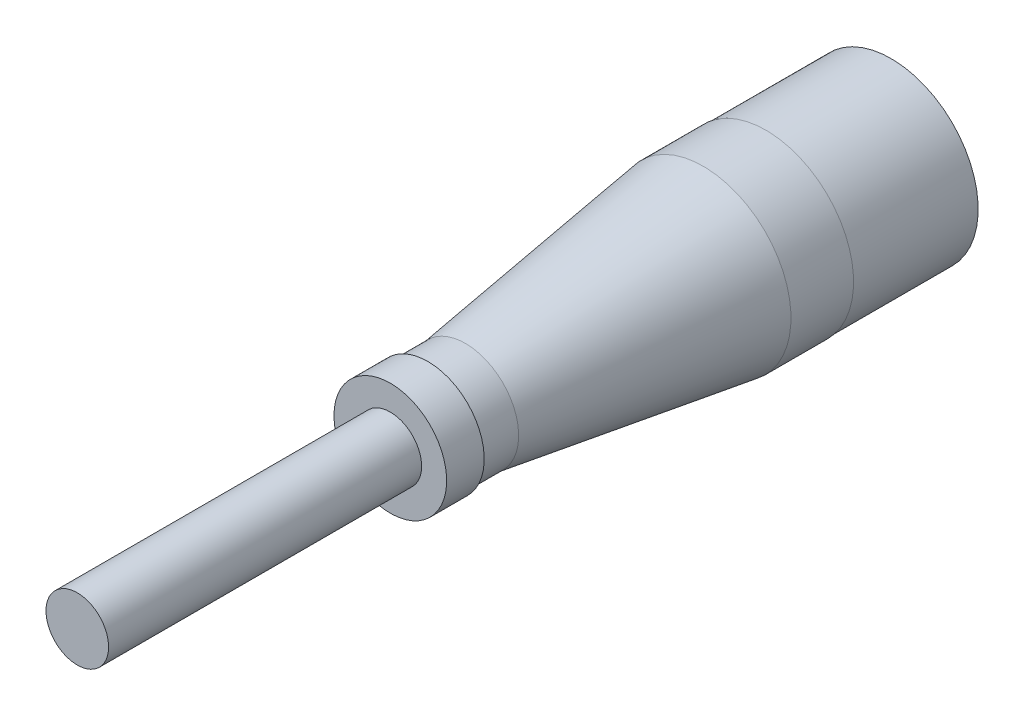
ISO-10303-21;
HEADER;
FILE_DESCRIPTION(('STEP AP214'),'2;1');
FILE_NAME('part.step','',(''),(''),'','','');
FILE_SCHEMA(('AUTOMOTIVE_DESIGN { 1 0 10303 214 1 1 1 1 }'));
ENDSEC;
DATA;
#1=APPLICATION_CONTEXT('core data for automotive mechanical design processes');
#2=APPLICATION_PROTOCOL_DEFINITION('international standard','automotive_design',2000,#1);
#3=PRODUCT_CONTEXT('',#1,'mechanical');
#4=PRODUCT('Part','Part','',(#3));
#5=PRODUCT_RELATED_PRODUCT_CATEGORY('part','',(#4));
#6=PRODUCT_DEFINITION_FORMATION('','',#4);
#7=PRODUCT_DEFINITION_CONTEXT('part definition',#1,'design');
#8=PRODUCT_DEFINITION('design','',#6,#7);
#9=PRODUCT_DEFINITION_SHAPE('','',#8);
#10=(LENGTH_UNIT() NAMED_UNIT(*) SI_UNIT(.MILLI.,.METRE.));
#11=(NAMED_UNIT(*) PLANE_ANGLE_UNIT() SI_UNIT($,.RADIAN.));
#12=(NAMED_UNIT(*) SI_UNIT($,.STERADIAN.) SOLID_ANGLE_UNIT());
#13=UNCERTAINTY_MEASURE_WITH_UNIT(LENGTH_MEASURE(1.E-05),#10,'distance_accuracy_value','');
#14=(GEOMETRIC_REPRESENTATION_CONTEXT(3) GLOBAL_UNCERTAINTY_ASSIGNED_CONTEXT((#13)) GLOBAL_UNIT_ASSIGNED_CONTEXT((#10,
#11,#12)) REPRESENTATION_CONTEXT('',''));
#15=CARTESIAN_POINT('',(0.,0.,0.));
#16=DIRECTION('',(0.,0.,1.));
#17=DIRECTION('',(1.,0.,0.));
#18=AXIS2_PLACEMENT_3D('',#15,#16,#17);
#19=CARTESIAN_POINT('',(-5.55111512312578E-13,1.22124532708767E-12,40.));
#20=DIRECTION('',(0.,0.,-0.999999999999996));
#21=DIRECTION('',(-1.,0.,0.));
#22=AXIS2_PLACEMENT_3D('',#19,#20,#21);
#23=PLANE('',#22);
#24=CARTESIAN_POINT('',(-5.55111512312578E-13,1.22124532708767E-12,40.));
#25=DIRECTION('',(0.,0.,-0.999999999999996));
#26=DIRECTION('',(-1.,0.,0.));
#27=AXIS2_PLACEMENT_3D('',#24,#25,#26);
#28=CIRCLE('',#27,4.5);
#29=CARTESIAN_POINT('',(-4.50000000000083,8.87928619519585E-13,40.));
#30=VERTEX_POINT('',#29);
#31=EDGE_CURVE('E83',#30,#30,#28,.T.);
#32=ORIENTED_EDGE('',*,*,#31,.F.);
#33=EDGE_LOOP('',(#32));
#34=FACE_BOUND('',#33,.T.);
#35=CARTESIAN_POINT('',(-5.55111512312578E-13,1.22124532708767E-12,40.));
#36=DIRECTION('',(0.,0.,-0.999999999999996));
#37=DIRECTION('',(-1.,0.,0.));
#38=AXIS2_PLACEMENT_3D('',#35,#36,#37);
#39=CIRCLE('',#38,2.5);
#40=CARTESIAN_POINT('',(-8.3252849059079E-13,2.50000000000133,40.));
#41=VERTEX_POINT('',#40);
#42=EDGE_CURVE('E10',#41,#41,#39,.F.);
#43=ORIENTED_EDGE('',*,*,#42,.F.);
#44=EDGE_LOOP('',(#43));
#45=FACE_BOUND('',#44,.T.);
#46=ADVANCED_FACE('F43',(#34,#45),#23,.F.);
#47=CARTESIAN_POINT('',(-6.66133814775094E-13,9.99200722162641E-13,10.));
#48=DIRECTION('',(0.,0.,-0.999999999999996));
#49=DIRECTION('',(-1.,0.,0.));
#50=AXIS2_PLACEMENT_3D('',#47,#48,#49);
#51=CYLINDRICAL_SURFACE('',#50,6.95);
#52=CARTESIAN_POINT('',(-6.66133814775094E-13,9.99200722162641E-13,10.));
#53=DIRECTION('',(0.,0.,0.999999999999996));
#54=DIRECTION('',(1.,0.,0.));
#55=AXIS2_PLACEMENT_3D('',#52,#53,#54);
#56=CIRCLE('',#55,6.95);
#57=CARTESIAN_POINT('',(-6.95000000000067,9.98814919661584E-13,10.));
#58=VERTEX_POINT('',#57);
#59=EDGE_CURVE('E51',#58,#58,#56,.T.);
#60=CARTESIAN_POINT('',(-8.32667268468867E-13,7.7715611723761E-13,0.));
#61=DIRECTION('',(0.,0.,0.999999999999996));
#62=DIRECTION('',(1.,0.,0.));
#63=AXIS2_PLACEMENT_3D('',#60,#61,#62);
#64=CIRCLE('',#63,6.95);
#65=CARTESIAN_POINT('',(-6.95000000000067,9.98814919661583E-13,0.));
#66=VERTEX_POINT('',#65);
#67=EDGE_CURVE('E58',#66,#66,#64,.T.);
#68=CARTESIAN_POINT('',(-6.95000000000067,9.98814919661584E-13,10.));
#69=CARTESIAN_POINT('',(-6.95000000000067,9.98814919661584E-13,9.89583333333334));
#70=CARTESIAN_POINT('',(-6.95000000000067,9.98814919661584E-13,9.79166666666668));
#71=CARTESIAN_POINT('',(-6.95000000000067,9.98814919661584E-13,9.58333333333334));
#72=CARTESIAN_POINT('',(-6.95000000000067,9.98814919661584E-13,9.47916666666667));
#73=CARTESIAN_POINT('',(-6.95000000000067,9.98814919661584E-13,9.27083333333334));
#74=CARTESIAN_POINT('',(-6.95000000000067,9.98814919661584E-13,9.16666666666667));
#75=CARTESIAN_POINT('',(-6.95000000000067,9.98814919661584E-13,8.95833333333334));
#76=CARTESIAN_POINT('',(-6.95000000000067,9.98814919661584E-13,8.85416666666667));
#77=CARTESIAN_POINT('',(-6.95000000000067,9.98814919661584E-13,8.64583333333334));
#78=CARTESIAN_POINT('',(-6.95000000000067,9.98814919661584E-13,8.54166666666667));
#79=CARTESIAN_POINT('',(-6.95000000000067,9.98814919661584E-13,8.33333333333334));
#80=CARTESIAN_POINT('',(-6.95000000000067,9.98814919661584E-13,8.22916666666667));
#81=CARTESIAN_POINT('',(-6.95000000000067,9.98814919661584E-13,8.02083333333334));
#82=CARTESIAN_POINT('',(-6.95000000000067,9.98814919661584E-13,7.91666666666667));
#83=CARTESIAN_POINT('',(-6.95000000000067,9.98814919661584E-13,7.70833333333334));
#84=CARTESIAN_POINT('',(-6.95000000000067,9.98814919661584E-13,7.60416666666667));
#85=CARTESIAN_POINT('',(-6.95000000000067,9.98814919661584E-13,7.39583333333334));
#86=CARTESIAN_POINT('',(-6.95000000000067,9.98814919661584E-13,7.29166666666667));
#87=CARTESIAN_POINT('',(-6.95000000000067,9.98814919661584E-13,7.08333333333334));
#88=CARTESIAN_POINT('',(-6.95000000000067,9.98814919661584E-13,6.97916666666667));
#89=CARTESIAN_POINT('',(-6.95000000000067,9.98814919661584E-13,6.77083333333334));
#90=CARTESIAN_POINT('',(-6.95000000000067,9.98814919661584E-13,6.66666666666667));
#91=CARTESIAN_POINT('',(-6.95000000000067,9.98814919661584E-13,6.45833333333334));
#92=CARTESIAN_POINT('',(-6.95000000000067,9.98814919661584E-13,6.35416666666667));
#93=CARTESIAN_POINT('',(-6.95000000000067,9.98814919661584E-13,6.14583333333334));
#94=CARTESIAN_POINT('',(-6.95000000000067,9.98814919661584E-13,6.04166666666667));
#95=CARTESIAN_POINT('',(-6.95000000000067,9.98814919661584E-13,5.83333333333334));
#96=CARTESIAN_POINT('',(-6.95000000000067,9.98814919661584E-13,5.72916666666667));
#97=CARTESIAN_POINT('',(-6.95000000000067,9.98814919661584E-13,5.52083333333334));
#98=CARTESIAN_POINT('',(-6.95000000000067,9.98814919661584E-13,5.41666666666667));
#99=CARTESIAN_POINT('',(-6.95000000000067,9.98814919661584E-13,5.20833333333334));
#100=CARTESIAN_POINT('',(-6.95000000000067,9.98814919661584E-13,5.10416666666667));
#101=CARTESIAN_POINT('',(-6.95000000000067,9.98814919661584E-13,4.89583333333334));
#102=CARTESIAN_POINT('',(-6.95000000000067,9.98814919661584E-13,4.79166666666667));
#103=CARTESIAN_POINT('',(-6.95000000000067,9.98814919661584E-13,4.58333333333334));
#104=CARTESIAN_POINT('',(-6.95000000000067,9.98814919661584E-13,4.47916666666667));
#105=CARTESIAN_POINT('',(-6.95000000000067,9.98814919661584E-13,4.27083333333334));
#106=CARTESIAN_POINT('',(-6.95000000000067,9.98814919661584E-13,4.16666666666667));
#107=CARTESIAN_POINT('',(-6.95000000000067,9.98814919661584E-13,3.95833333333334));
#108=CARTESIAN_POINT('',(-6.95000000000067,9.98814919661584E-13,3.85416666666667));
#109=CARTESIAN_POINT('',(-6.95000000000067,9.98814919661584E-13,3.64583333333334));
#110=CARTESIAN_POINT('',(-6.95000000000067,9.98814919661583E-13,3.54166666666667));
#111=CARTESIAN_POINT('',(-6.95000000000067,9.98814919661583E-13,3.33333333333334));
#112=CARTESIAN_POINT('',(-6.95000000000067,9.98814919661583E-13,3.22916666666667));
#113=CARTESIAN_POINT('',(-6.95000000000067,9.98814919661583E-13,3.02083333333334));
#114=CARTESIAN_POINT('',(-6.95000000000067,9.98814919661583E-13,2.91666666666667));
#115=CARTESIAN_POINT('',(-6.95000000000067,9.98814919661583E-13,2.70833333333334));
#116=CARTESIAN_POINT('',(-6.95000000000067,9.98814919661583E-13,2.60416666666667));
#117=CARTESIAN_POINT('',(-6.95000000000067,9.98814919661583E-13,2.39583333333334));
#118=CARTESIAN_POINT('',(-6.95000000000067,9.98814919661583E-13,2.29166666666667));
#119=CARTESIAN_POINT('',(-6.95000000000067,9.98814919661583E-13,2.08333333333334));
#120=CARTESIAN_POINT('',(-6.95000000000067,9.98814919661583E-13,1.97916666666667));
#121=CARTESIAN_POINT('',(-6.95000000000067,9.98814919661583E-13,1.77083333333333));
#122=CARTESIAN_POINT('',(-6.95000000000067,9.98814919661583E-13,1.66666666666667));
#123=CARTESIAN_POINT('',(-6.95000000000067,9.98814919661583E-13,1.45833333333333));
#124=CARTESIAN_POINT('',(-6.95000000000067,9.98814919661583E-13,1.35416666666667));
#125=CARTESIAN_POINT('',(-6.95000000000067,9.98814919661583E-13,1.14583333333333));
#126=CARTESIAN_POINT('',(-6.95000000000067,9.98814919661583E-13,1.04166666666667));
#127=CARTESIAN_POINT('',(-6.95000000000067,9.98814919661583E-13,0.833333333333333));
#128=CARTESIAN_POINT('',(-6.95000000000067,9.98814919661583E-13,0.729166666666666));
#129=CARTESIAN_POINT('',(-6.95000000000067,9.98814919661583E-13,0.520833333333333));
#130=CARTESIAN_POINT('',(-6.95000000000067,9.98814919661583E-13,0.416666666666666));
#131=CARTESIAN_POINT('',(-6.95000000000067,9.98814919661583E-13,0.208333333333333));
#132=CARTESIAN_POINT('',(-6.95000000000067,9.98814919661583E-13,0.104166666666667));
#133=CARTESIAN_POINT('',(-6.95000000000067,9.98814919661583E-13,0.));
#134=B_SPLINE_CURVE_WITH_KNOTS('',3,(#68,#69,#70,#71,#72,#73,#74,#75,#76,#77,#78,#79,#80,#81,
#82,#83,#84,#85,#86,#87,#88,#89,#90,#91,#92,#93,#94,#95,#96,#97,#98,#99,#100,#101,#102,#103,
#104,#105,#106,#107,#108,#109,#110,#111,#112,#113,#114,#115,#116,#117,#118,#119,#120,#121,#122,
#123,#124,#125,#126,#127,#128,#129,#130,#131,#132,#133),.UNSPECIFIED.,.F.,.F.,(4,2,2,2,2,2,2,2,
2,2,2,2,2,2,2,2,2,2,2,2,2,2,2,2,2,2,2,2,2,2,2,2,4),(0.,0.3125,0.625000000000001,
0.937500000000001,1.25,1.5625,1.875,2.1875,2.5,2.8125,3.125,3.4375,3.75,4.0625,4.375,4.6875,5.,
5.3125,5.62500000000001,5.9375,6.25000000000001,6.56250000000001,6.87500000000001,
7.18750000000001,7.50000000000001,7.81250000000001,8.12500000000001,8.43750000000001,
8.75000000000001,9.06250000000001,9.37500000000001,9.68750000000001,10.),.UNSPECIFIED.);
#135=EDGE_CURVE('BSEAM45',#58,#66,#134,.T.);
#136=ORIENTED_EDGE('',*,*,#59,.F.);
#137=ORIENTED_EDGE('',*,*,#67,.T.);
#138=ORIENTED_EDGE('',*,*,#135,.T.);
#139=ORIENTED_EDGE('',*,*,#135,.F.);
#140=EDGE_LOOP('',(#136,#138,#137,#139));
#141=FACE_BOUND('',#140,.T.);
#142=ADVANCED_FACE('F45',(#141),#51,.T.);
#143=CARTESIAN_POINT('',(-8.32667268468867E-13,7.7715611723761E-13,0.));
#144=DIRECTION('',(0.,0.,0.999999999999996));
#145=DIRECTION('',(1.,0.,0.));
#146=AXIS2_PLACEMENT_3D('',#143,#144,#145);
#147=PLANE('',#146);
#148=CARTESIAN_POINT('',(-8.32667268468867E-13,7.7715611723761E-13,0.));
#149=DIRECTION('',(0.,0.,-0.999999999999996));
#150=DIRECTION('',(-1.,0.,0.));
#151=AXIS2_PLACEMENT_3D('',#148,#149,#150);
#152=CIRCLE('',#151,6.);
#153=CARTESIAN_POINT('',(-6.00000000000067,9.98867655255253E-13,0.));
#154=VERTEX_POINT('',#153);
#155=EDGE_CURVE('E95',#154,#154,#152,.T.);
#156=ORIENTED_EDGE('',*,*,#155,.F.);
#157=EDGE_LOOP('',(#156));
#158=FACE_BOUND('',#157,.T.);
#159=ORIENTED_EDGE('',*,*,#67,.F.);
#160=EDGE_LOOP('',(#159));
#161=FACE_BOUND('',#160,.T.);
#162=ADVANCED_FACE('F102',(#158,#161),#147,.F.);
#163=CARTESIAN_POINT('',(-6.66133814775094E-13,9.99200722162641E-13,10.));
#164=DIRECTION('',(0.,0.,0.999999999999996));
#165=DIRECTION('',(1.,0.,0.));
#166=AXIS2_PLACEMENT_3D('',#163,#164,#165);
#167=PLANE('',#166);
#168=CARTESIAN_POINT('',(-6.66133814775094E-13,9.99200722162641E-13,10.));
#169=DIRECTION('',(0.,0.,0.999999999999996));
#170=DIRECTION('',(1.,0.,0.));
#171=AXIS2_PLACEMENT_3D('',#168,#169,#170);
#172=CIRCLE('',#171,7.);
#173=CARTESIAN_POINT('',(-7.00000000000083,8.87789841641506E-13,10.));
#174=VERTEX_POINT('',#173);
#175=EDGE_CURVE('E70',#174,#174,#172,.T.);
#176=ORIENTED_EDGE('',*,*,#175,.F.);
#177=EDGE_LOOP('',(#176));
#178=FACE_BOUND('',#177,.T.);
#179=ORIENTED_EDGE('',*,*,#59,.T.);
#180=EDGE_LOOP('',(#179));
#181=FACE_BOUND('',#180,.T.);
#182=ADVANCED_FACE('F105',(#178,#181),#167,.F.);
#183=CARTESIAN_POINT('',(-8.32667268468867E-13,8.88178419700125E-13,15.));
#184=DIRECTION('',(0.,0.,-0.999999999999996));
#185=DIRECTION('',(-1.,0.,0.));
#186=AXIS2_PLACEMENT_3D('',#183,#184,#185);
#187=CYLINDRICAL_SURFACE('',#186,7.);
#188=CARTESIAN_POINT('',(-8.32667268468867E-13,8.88178419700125E-13,15.));
#189=DIRECTION('',(0.,0.,0.999999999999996));
#190=DIRECTION('',(1.,0.,0.));
#191=AXIS2_PLACEMENT_3D('',#188,#189,#190);
#192=CIRCLE('',#191,7.);
#193=CARTESIAN_POINT('',(-7.00000000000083,8.87789841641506E-13,15.));
#194=VERTEX_POINT('',#193);
#195=EDGE_CURVE('E64',#194,#194,#192,.T.);
#196=CARTESIAN_POINT('',(-7.00000000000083,8.87789841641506E-13,15.));
#197=CARTESIAN_POINT('',(-7.00000000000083,8.87789841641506E-13,14.9479166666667));
#198=CARTESIAN_POINT('',(-7.00000000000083,8.87789841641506E-13,14.8958333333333));
#199=CARTESIAN_POINT('',(-7.00000000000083,8.87789841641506E-13,14.7916666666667));
#200=CARTESIAN_POINT('',(-7.00000000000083,8.87789841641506E-13,14.7395833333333));
#201=CARTESIAN_POINT('',(-7.00000000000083,8.87789841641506E-13,14.6354166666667));
#202=CARTESIAN_POINT('',(-7.00000000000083,8.87789841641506E-13,14.5833333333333));
#203=CARTESIAN_POINT('',(-7.00000000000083,8.87789841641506E-13,14.4791666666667));
#204=CARTESIAN_POINT('',(-7.00000000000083,8.87789841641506E-13,14.4270833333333));
#205=CARTESIAN_POINT('',(-7.00000000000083,8.87789841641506E-13,14.3229166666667));
#206=CARTESIAN_POINT('',(-7.00000000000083,8.87789841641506E-13,14.2708333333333));
#207=CARTESIAN_POINT('',(-7.00000000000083,8.87789841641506E-13,14.1666666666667));
#208=CARTESIAN_POINT('',(-7.00000000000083,8.87789841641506E-13,14.1145833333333));
#209=CARTESIAN_POINT('',(-7.00000000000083,8.87789841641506E-13,14.0104166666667));
#210=CARTESIAN_POINT('',(-7.00000000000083,8.87789841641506E-13,13.9583333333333));
#211=CARTESIAN_POINT('',(-7.00000000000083,8.87789841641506E-13,13.8541666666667));
#212=CARTESIAN_POINT('',(-7.00000000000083,8.87789841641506E-13,13.8020833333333));
#213=CARTESIAN_POINT('',(-7.00000000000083,8.87789841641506E-13,13.6979166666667));
#214=CARTESIAN_POINT('',(-7.00000000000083,8.87789841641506E-13,13.6458333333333));
#215=CARTESIAN_POINT('',(-7.00000000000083,8.87789841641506E-13,13.5416666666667));
#216=CARTESIAN_POINT('',(-7.00000000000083,8.87789841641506E-13,13.4895833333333));
#217=CARTESIAN_POINT('',(-7.00000000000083,8.87789841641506E-13,13.3854166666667));
#218=CARTESIAN_POINT('',(-7.00000000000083,8.87789841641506E-13,13.3333333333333));
#219=CARTESIAN_POINT('',(-7.00000000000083,8.87789841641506E-13,13.2291666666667));
#220=CARTESIAN_POINT('',(-7.00000000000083,8.87789841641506E-13,13.1770833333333));
#221=CARTESIAN_POINT('',(-7.00000000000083,8.87789841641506E-13,13.0729166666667));
#222=CARTESIAN_POINT('',(-7.00000000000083,8.87789841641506E-13,13.0208333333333));
#223=CARTESIAN_POINT('',(-7.00000000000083,8.87789841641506E-13,12.9166666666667));
#224=CARTESIAN_POINT('',(-7.00000000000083,8.87789841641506E-13,12.8645833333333));
#225=CARTESIAN_POINT('',(-7.00000000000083,8.87789841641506E-13,12.7604166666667));
#226=CARTESIAN_POINT('',(-7.00000000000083,8.87789841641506E-13,12.7083333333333));
#227=CARTESIAN_POINT('',(-7.00000000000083,8.87789841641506E-13,12.6041666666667));
#228=CARTESIAN_POINT('',(-7.00000000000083,8.87789841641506E-13,12.5520833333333));
#229=CARTESIAN_POINT('',(-7.00000000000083,8.87789841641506E-13,12.4479166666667));
#230=CARTESIAN_POINT('',(-7.00000000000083,8.87789841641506E-13,12.3958333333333));
#231=CARTESIAN_POINT('',(-7.00000000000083,8.87789841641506E-13,12.2916666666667));
#232=CARTESIAN_POINT('',(-7.00000000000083,8.87789841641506E-13,12.2395833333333));
#233=CARTESIAN_POINT('',(-7.00000000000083,8.87789841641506E-13,12.1354166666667));
#234=CARTESIAN_POINT('',(-7.00000000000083,8.87789841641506E-13,12.0833333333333));
#235=CARTESIAN_POINT('',(-7.00000000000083,8.87789841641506E-13,11.9791666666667));
#236=CARTESIAN_POINT('',(-7.00000000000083,8.87789841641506E-13,11.9270833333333));
#237=CARTESIAN_POINT('',(-7.00000000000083,8.87789841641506E-13,11.8229166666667));
#238=CARTESIAN_POINT('',(-7.00000000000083,8.87789841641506E-13,11.7708333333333));
#239=CARTESIAN_POINT('',(-7.00000000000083,8.87789841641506E-13,11.6666666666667));
#240=CARTESIAN_POINT('',(-7.00000000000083,8.87789841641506E-13,11.6145833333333));
#241=CARTESIAN_POINT('',(-7.00000000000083,8.87789841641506E-13,11.5104166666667));
#242=CARTESIAN_POINT('',(-7.00000000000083,8.87789841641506E-13,11.4583333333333));
#243=CARTESIAN_POINT('',(-7.00000000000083,8.87789841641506E-13,11.3541666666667));
#244=CARTESIAN_POINT('',(-7.00000000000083,8.87789841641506E-13,11.3020833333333));
#245=CARTESIAN_POINT('',(-7.00000000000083,8.87789841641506E-13,11.1979166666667));
#246=CARTESIAN_POINT('',(-7.00000000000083,8.87789841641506E-13,11.1458333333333));
#247=CARTESIAN_POINT('',(-7.00000000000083,8.87789841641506E-13,11.0416666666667));
#248=CARTESIAN_POINT('',(-7.00000000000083,8.87789841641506E-13,10.9895833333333));
#249=CARTESIAN_POINT('',(-7.00000000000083,8.87789841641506E-13,10.8854166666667));
#250=CARTESIAN_POINT('',(-7.00000000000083,8.87789841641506E-13,10.8333333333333));
#251=CARTESIAN_POINT('',(-7.00000000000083,8.87789841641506E-13,10.7291666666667));
#252=CARTESIAN_POINT('',(-7.00000000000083,8.87789841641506E-13,10.6770833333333));
#253=CARTESIAN_POINT('',(-7.00000000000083,8.87789841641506E-13,10.5729166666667));
#254=CARTESIAN_POINT('',(-7.00000000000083,8.87789841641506E-13,10.5208333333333));
#255=CARTESIAN_POINT('',(-7.00000000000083,8.87789841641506E-13,10.4166666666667));
#256=CARTESIAN_POINT('',(-7.00000000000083,8.87789841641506E-13,10.3645833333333));
#257=CARTESIAN_POINT('',(-7.00000000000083,8.87789841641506E-13,10.2604166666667));
#258=CARTESIAN_POINT('',(-7.00000000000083,8.87789841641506E-13,10.2083333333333));
#259=CARTESIAN_POINT('',(-7.00000000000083,8.87789841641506E-13,10.1041666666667));
#260=CARTESIAN_POINT('',(-7.00000000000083,8.87789841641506E-13,10.0520833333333));
#261=CARTESIAN_POINT('',(-7.00000000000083,8.87789841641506E-13,10.));
#262=B_SPLINE_CURVE_WITH_KNOTS('',3,(#196,#197,#198,#199,#200,#201,#202,#203,#204,#205,#206,
#207,#208,#209,#210,#211,#212,#213,#214,#215,#216,#217,#218,#219,#220,#221,#222,#223,#224,#225,
#226,#227,#228,#229,#230,#231,#232,#233,#234,#235,#236,#237,#238,#239,#240,#241,#242,#243,#244,
#245,#246,#247,#248,#249,#250,#251,#252,#253,#254,#255,#256,#257,#258,#259,#260,#261),
.UNSPECIFIED.,.F.,.F.,(4,2,2,2,2,2,2,2,2,2,2,2,2,2,2,2,2,2,2,2,2,2,2,2,2,2,2,2,2,2,2,2,4),(0.,
0.156249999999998,0.312499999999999,0.468749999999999,0.624999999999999,0.781249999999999,
0.937499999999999,1.09375,1.25,1.40625,1.5625,1.71875,1.875,2.03125,2.1875,2.34375,2.5,2.65625,
2.8125,2.96875,3.125,3.28125,3.4375,3.59375,3.75,3.90625,4.0625,4.21875,4.375,4.53125,4.6875,
4.84375,5.),.UNSPECIFIED.);
#263=EDGE_CURVE('BSEAM125',#194,#174,#262,.T.);
#264=ORIENTED_EDGE('',*,*,#195,.F.);
#265=ORIENTED_EDGE('',*,*,#175,.T.);
#266=ORIENTED_EDGE('',*,*,#263,.T.);
#267=ORIENTED_EDGE('',*,*,#263,.F.);
#268=EDGE_LOOP('',(#264,#266,#265,#267));
#269=FACE_BOUND('',#268,.T.);
#270=ADVANCED_FACE('F125',(#269),#187,.T.);
#271=CARTESIAN_POINT('',(-8.32667268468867E-13,9.99200722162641E-13,34.));
#272=DIRECTION('',(0.,0.,-0.999999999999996));
#273=DIRECTION('',(-1.,0.,0.));
#274=AXIS2_PLACEMENT_3D('',#271,#272,#273);
#275=CONICAL_SURFACE('',#274,4.25,0.143738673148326);
#276=CARTESIAN_POINT('',(-8.32667268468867E-13,9.99200722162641E-13,34.));
#277=DIRECTION('',(0.,0.,-0.999999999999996));
#278=DIRECTION('',(-1.,0.,0.));
#279=AXIS2_PLACEMENT_3D('',#276,#277,#278);
#280=CIRCLE('',#279,4.25);
#281=CARTESIAN_POINT('',(-4.25000000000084,9.98964799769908E-13,34.));
#282=VERTEX_POINT('',#281);
#283=EDGE_CURVE('E73',#282,#282,#280,.T.);
#284=CARTESIAN_POINT('',(-7.00000000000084,9.98812144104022E-13,15.));
#285=CARTESIAN_POINT('',(-6.97135416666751,9.98813734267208E-13,15.1979166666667));
#286=CARTESIAN_POINT('',(-6.94270833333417,9.98815324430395E-13,15.3958333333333));
#287=CARTESIAN_POINT('',(-6.88541666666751,9.98818504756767E-13,15.7916666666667));
#288=CARTESIAN_POINT('',(-6.85677083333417,9.98820094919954E-13,15.9895833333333));
#289=CARTESIAN_POINT('',(-6.79947916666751,9.98823275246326E-13,16.3854166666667));
#290=CARTESIAN_POINT('',(-6.77083333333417,9.98824865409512E-13,16.5833333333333));
#291=CARTESIAN_POINT('',(-6.71354166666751,9.98828045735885E-13,16.9791666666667));
#292=CARTESIAN_POINT('',(-6.68489583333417,9.98829635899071E-13,17.1770833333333));
#293=CARTESIAN_POINT('',(-6.6276041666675,9.98832816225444E-13,17.5729166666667));
#294=CARTESIAN_POINT('',(-6.59895833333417,9.9883440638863E-13,17.7708333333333));
#295=CARTESIAN_POINT('',(-6.54166666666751,9.98837586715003E-13,18.1666666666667));
#296=CARTESIAN_POINT('',(-6.51302083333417,9.98839176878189E-13,18.3645833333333));
#297=CARTESIAN_POINT('',(-6.45572916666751,9.98842357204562E-13,18.7604166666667));
#298=CARTESIAN_POINT('',(-6.42708333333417,9.98843947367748E-13,18.9583333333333));
#299=CARTESIAN_POINT('',(-6.36979166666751,9.98847127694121E-13,19.3541666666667));
#300=CARTESIAN_POINT('',(-6.34114583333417,9.98848717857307E-13,19.5520833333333));
#301=CARTESIAN_POINT('',(-6.2838541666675,9.9885189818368E-13,19.9479166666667));
#302=CARTESIAN_POINT('',(-6.25520833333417,9.98853488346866E-13,20.1458333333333));
#303=CARTESIAN_POINT('',(-6.19791666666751,9.98856668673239E-13,20.5416666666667));
#304=CARTESIAN_POINT('',(-6.16927083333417,9.98858258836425E-13,20.7395833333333));
#305=CARTESIAN_POINT('',(-6.1119791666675,9.98861439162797E-13,21.1354166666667));
#306=CARTESIAN_POINT('',(-6.08333333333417,9.98863029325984E-13,21.3333333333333));
#307=CARTESIAN_POINT('',(-6.02604166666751,9.98866209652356E-13,21.7291666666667));
#308=CARTESIAN_POINT('',(-5.99739583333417,9.98867799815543E-13,21.9270833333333));
#309=CARTESIAN_POINT('',(-5.9401041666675,9.98870980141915E-13,22.3229166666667));
#310=CARTESIAN_POINT('',(-5.91145833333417,9.98872570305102E-13,22.5208333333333));
#311=CARTESIAN_POINT('',(-5.85416666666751,9.98875750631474E-13,22.9166666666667));
#312=CARTESIAN_POINT('',(-5.82552083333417,9.98877340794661E-13,23.1145833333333));
#313=CARTESIAN_POINT('',(-5.7682291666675,9.98880521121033E-13,23.5104166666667));
#314=CARTESIAN_POINT('',(-5.73958333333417,9.9888211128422E-13,23.7083333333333));
#315=CARTESIAN_POINT('',(-5.6822916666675,9.98885291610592E-13,24.1041666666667));
#316=CARTESIAN_POINT('',(-5.65364583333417,9.98886881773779E-13,24.3020833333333));
#317=CARTESIAN_POINT('',(-5.5963541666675,9.98890062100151E-13,24.6979166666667));
#318=CARTESIAN_POINT('',(-5.56770833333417,9.98891652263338E-13,24.8958333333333));
#319=CARTESIAN_POINT('',(-5.5104166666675,9.9889483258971E-13,25.2916666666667));
#320=CARTESIAN_POINT('',(-5.48177083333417,9.98896422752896E-13,25.4895833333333));
#321=CARTESIAN_POINT('',(-5.4244791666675,9.98899603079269E-13,25.8854166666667));
#322=CARTESIAN_POINT('',(-5.39583333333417,9.98901193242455E-13,26.0833333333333));
#323=CARTESIAN_POINT('',(-5.3385416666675,9.98904373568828E-13,26.4791666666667));
#324=CARTESIAN_POINT('',(-5.30989583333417,9.98905963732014E-13,26.6770833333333));
#325=CARTESIAN_POINT('',(-5.2526041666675,9.98909144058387E-13,27.0729166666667));
#326=CARTESIAN_POINT('',(-5.22395833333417,9.98910734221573E-13,27.2708333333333));
#327=CARTESIAN_POINT('',(-5.1666666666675,9.98913914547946E-13,27.6666666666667));
#328=CARTESIAN_POINT('',(-5.13802083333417,9.98915504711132E-13,27.8645833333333));
#329=CARTESIAN_POINT('',(-5.0807291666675,9.98918685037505E-13,28.2604166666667));
#330=CARTESIAN_POINT('',(-5.05208333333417,9.98920275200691E-13,28.4583333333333));
#331=CARTESIAN_POINT('',(-4.9947916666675,9.98923455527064E-13,28.8541666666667));
#332=CARTESIAN_POINT('',(-4.96614583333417,9.9892504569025E-13,29.0520833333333));
#333=CARTESIAN_POINT('',(-4.9088541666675,9.98928226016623E-13,29.4479166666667));
#334=CARTESIAN_POINT('',(-4.88020833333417,9.98929816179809E-13,29.6458333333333));
#335=CARTESIAN_POINT('',(-4.8229166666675,9.98932996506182E-13,30.0416666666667));
#336=CARTESIAN_POINT('',(-4.79427083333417,9.98934586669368E-13,30.2395833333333));
#337=CARTESIAN_POINT('',(-4.7369791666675,9.98937766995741E-13,30.6354166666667));
#338=CARTESIAN_POINT('',(-4.70833333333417,9.98939357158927E-13,30.8333333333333));
#339=CARTESIAN_POINT('',(-4.6510416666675,9.989425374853E-13,31.2291666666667));
#340=CARTESIAN_POINT('',(-4.62239583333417,9.98944127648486E-13,31.4270833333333));
#341=CARTESIAN_POINT('',(-4.5651041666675,9.98947307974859E-13,31.8229166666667));
#342=CARTESIAN_POINT('',(-4.53645833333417,9.98948898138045E-13,32.0208333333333));
#343=CARTESIAN_POINT('',(-4.4791666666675,9.98952078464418E-13,32.4166666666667));
#344=CARTESIAN_POINT('',(-4.45052083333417,9.98953668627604E-13,32.6145833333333));
#345=CARTESIAN_POINT('',(-4.3932291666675,9.98956848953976E-13,33.0104166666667));
#346=CARTESIAN_POINT('',(-4.36458333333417,9.98958439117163E-13,33.2083333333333));
#347=CARTESIAN_POINT('',(-4.3072916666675,9.98961619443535E-13,33.6041666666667));
#348=CARTESIAN_POINT('',(-4.27864583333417,9.98963209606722E-13,33.8020833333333));
#349=CARTESIAN_POINT('',(-4.25000000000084,9.98964799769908E-13,34.));
#350=B_SPLINE_CURVE_WITH_KNOTS('',3,(#284,#285,#286,#287,#288,#289,#290,#291,#292,#293,#294,
#295,#296,#297,#298,#299,#300,#301,#302,#303,#304,#305,#306,#307,#308,#309,#310,#311,#312,#313,
#314,#315,#316,#317,#318,#319,#320,#321,#322,#323,#324,#325,#326,#327,#328,#329,#330,#331,#332,
#333,#334,#335,#336,#337,#338,#339,#340,#341,#342,#343,#344,#345,#346,#347,#348,#349),
.UNSPECIFIED.,.F.,.F.,(4,2,2,2,2,2,2,2,2,2,2,2,2,2,2,2,2,2,2,2,2,2,2,2,2,2,2,2,2,2,2,2,4),(0.,
0.599936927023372,1.19987385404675,1.79981078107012,2.3997477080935,2.99968463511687,
3.59962156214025,4.19955848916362,4.79949541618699,5.39943234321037,5.99936927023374,
6.59930619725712,7.19924312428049,7.79918005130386,8.39911697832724,8.99905390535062,
9.59899083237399,10.1989277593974,10.7988646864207,11.3988016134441,11.9987385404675,
12.5986754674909,13.1986123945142,13.7985493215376,14.398486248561,14.9984231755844,
15.5983601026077,16.1982970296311,16.7982339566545,17.3981708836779,17.9981078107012,
18.5980447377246,19.197981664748),.UNSPECIFIED.);
#351=EDGE_CURVE('BSEAM121',#194,#282,#350,.T.);
#352=ORIENTED_EDGE('',*,*,#195,.T.);
#353=ORIENTED_EDGE('',*,*,#283,.T.);
#354=ORIENTED_EDGE('',*,*,#351,.T.);
#355=ORIENTED_EDGE('',*,*,#351,.F.);
#356=EDGE_LOOP('',(#352,#354,#353,#355));
#357=FACE_BOUND('',#356,.T.);
#358=ADVANCED_FACE('F121',(#357),#275,.T.);
#359=CARTESIAN_POINT('',(-8.32667268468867E-13,8.88178419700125E-13,15.));
#360=DIRECTION('',(0.,0.,-0.999999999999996));
#361=DIRECTION('',(-1.,0.,0.));
#362=AXIS2_PLACEMENT_3D('',#359,#360,#361);
#363=CYLINDRICAL_SURFACE('',#362,4.25);
#364=CARTESIAN_POINT('',(0.,0.,37.));
#365=DIRECTION('',(0.,0.,-0.999999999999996));
#366=DIRECTION('',(-1.,0.,0.));
#367=AXIS2_PLACEMENT_3D('',#364,#365,#366);
#368=CIRCLE('',#367,4.25);
#369=CARTESIAN_POINT('',(-4.25000000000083,8.87942497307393E-13,37.));
#370=VERTEX_POINT('',#369);
#371=EDGE_CURVE('E76',#370,#370,#368,.T.);
#372=CARTESIAN_POINT('',(-4.25000000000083,8.87942497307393E-13,34.));
#373=CARTESIAN_POINT('',(-4.25000000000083,8.87942497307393E-13,34.03125));
#374=CARTESIAN_POINT('',(-4.25000000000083,8.87942497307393E-13,34.0625));
#375=CARTESIAN_POINT('',(-4.25000000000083,8.87942497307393E-13,34.125));
#376=CARTESIAN_POINT('',(-4.25000000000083,8.87942497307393E-13,34.15625));
#377=CARTESIAN_POINT('',(-4.25000000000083,8.87942497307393E-13,34.21875));
#378=CARTESIAN_POINT('',(-4.25000000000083,8.87942497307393E-13,34.25));
#379=CARTESIAN_POINT('',(-4.25000000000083,8.87942497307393E-13,34.3125));
#380=CARTESIAN_POINT('',(-4.25000000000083,8.87942497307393E-13,34.34375));
#381=CARTESIAN_POINT('',(-4.25000000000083,8.87942497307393E-13,34.40625));
#382=CARTESIAN_POINT('',(-4.25000000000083,8.87942497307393E-13,34.4375));
#383=CARTESIAN_POINT('',(-4.25000000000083,8.87942497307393E-13,34.5));
#384=CARTESIAN_POINT('',(-4.25000000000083,8.87942497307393E-13,34.53125));
#385=CARTESIAN_POINT('',(-4.25000000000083,8.87942497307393E-13,34.59375));
#386=CARTESIAN_POINT('',(-4.25000000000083,8.87942497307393E-13,34.625));
#387=CARTESIAN_POINT('',(-4.25000000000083,8.87942497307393E-13,34.6875));
#388=CARTESIAN_POINT('',(-4.25000000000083,8.87942497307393E-13,34.71875));
#389=CARTESIAN_POINT('',(-4.25000000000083,8.87942497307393E-13,34.78125));
#390=CARTESIAN_POINT('',(-4.25000000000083,8.87942497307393E-13,34.8125));
#391=CARTESIAN_POINT('',(-4.25000000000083,8.87942497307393E-13,34.875));
#392=CARTESIAN_POINT('',(-4.25000000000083,8.87942497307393E-13,34.90625));
#393=CARTESIAN_POINT('',(-4.25000000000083,8.87942497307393E-13,34.96875));
#394=CARTESIAN_POINT('',(-4.25000000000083,8.87942497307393E-13,35.));
#395=CARTESIAN_POINT('',(-4.25000000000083,8.87942497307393E-13,35.0625));
#396=CARTESIAN_POINT('',(-4.25000000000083,8.87942497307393E-13,35.09375));
#397=CARTESIAN_POINT('',(-4.25000000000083,8.87942497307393E-13,35.15625));
#398=CARTESIAN_POINT('',(-4.25000000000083,8.87942497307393E-13,35.1875));
#399=CARTESIAN_POINT('',(-4.25000000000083,8.87942497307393E-13,35.25));
#400=CARTESIAN_POINT('',(-4.25000000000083,8.87942497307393E-13,35.28125));
#401=CARTESIAN_POINT('',(-4.25000000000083,8.87942497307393E-13,35.34375));
#402=CARTESIAN_POINT('',(-4.25000000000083,8.87942497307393E-13,35.375));
#403=CARTESIAN_POINT('',(-4.25000000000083,8.87942497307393E-13,35.4375));
#404=CARTESIAN_POINT('',(-4.25000000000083,8.87942497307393E-13,35.46875));
#405=CARTESIAN_POINT('',(-4.25000000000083,8.87942497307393E-13,35.53125));
#406=CARTESIAN_POINT('',(-4.25000000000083,8.87942497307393E-13,35.5625));
#407=CARTESIAN_POINT('',(-4.25000000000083,8.87942497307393E-13,35.625));
#408=CARTESIAN_POINT('',(-4.25000000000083,8.87942497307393E-13,35.65625));
#409=CARTESIAN_POINT('',(-4.25000000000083,8.87942497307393E-13,35.71875));
#410=CARTESIAN_POINT('',(-4.25000000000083,8.87942497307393E-13,35.75));
#411=CARTESIAN_POINT('',(-4.25000000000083,8.87942497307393E-13,35.8125));
#412=CARTESIAN_POINT('',(-4.25000000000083,8.87942497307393E-13,35.84375));
#413=CARTESIAN_POINT('',(-4.25000000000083,8.87942497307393E-13,35.90625));
#414=CARTESIAN_POINT('',(-4.25000000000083,8.87942497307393E-13,35.9375));
#415=CARTESIAN_POINT('',(-4.25000000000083,8.87942497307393E-13,36.));
#416=CARTESIAN_POINT('',(-4.25000000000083,8.87942497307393E-13,36.03125));
#417=CARTESIAN_POINT('',(-4.25000000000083,8.87942497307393E-13,36.09375));
#418=CARTESIAN_POINT('',(-4.25000000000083,8.87942497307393E-13,36.125));
#419=CARTESIAN_POINT('',(-4.25000000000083,8.87942497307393E-13,36.1875));
#420=CARTESIAN_POINT('',(-4.25000000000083,8.87942497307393E-13,36.21875));
#421=CARTESIAN_POINT('',(-4.25000000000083,8.87942497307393E-13,36.28125));
#422=CARTESIAN_POINT('',(-4.25000000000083,8.87942497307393E-13,36.3125));
#423=CARTESIAN_POINT('',(-4.25000000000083,8.87942497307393E-13,36.375));
#424=CARTESIAN_POINT('',(-4.25000000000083,8.87942497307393E-13,36.40625));
#425=CARTESIAN_POINT('',(-4.25000000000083,8.87942497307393E-13,36.46875));
#426=CARTESIAN_POINT('',(-4.25000000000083,8.87942497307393E-13,36.5));
#427=CARTESIAN_POINT('',(-4.25000000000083,8.87942497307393E-13,36.5625));
#428=CARTESIAN_POINT('',(-4.25000000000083,8.87942497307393E-13,36.59375));
#429=CARTESIAN_POINT('',(-4.25000000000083,8.87942497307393E-13,36.65625));
#430=CARTESIAN_POINT('',(-4.25000000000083,8.87942497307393E-13,36.6875));
#431=CARTESIAN_POINT('',(-4.25000000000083,8.87942497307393E-13,36.75));
#432=CARTESIAN_POINT('',(-4.25000000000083,8.87942497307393E-13,36.78125));
#433=CARTESIAN_POINT('',(-4.25000000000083,8.87942497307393E-13,36.84375));
#434=CARTESIAN_POINT('',(-4.25000000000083,8.87942497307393E-13,36.875));
#435=CARTESIAN_POINT('',(-4.25000000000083,8.87942497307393E-13,36.9375));
#436=CARTESIAN_POINT('',(-4.25000000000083,8.87942497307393E-13,36.96875));
#437=CARTESIAN_POINT('',(-4.25000000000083,8.87942497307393E-13,37.));
#438=B_SPLINE_CURVE_WITH_KNOTS('',3,(#372,#373,#374,#375,#376,#377,#378,#379,#380,#381,#382,
#383,#384,#385,#386,#387,#388,#389,#390,#391,#392,#393,#394,#395,#396,#397,#398,#399,#400,#401,
#402,#403,#404,#405,#406,#407,#408,#409,#410,#411,#412,#413,#414,#415,#416,#417,#418,#419,#420,
#421,#422,#423,#424,#425,#426,#427,#428,#429,#430,#431,#432,#433,#434,#435,#436,#437),
.UNSPECIFIED.,.F.,.F.,(4,2,2,2,2,2,2,2,2,2,2,2,2,2,2,2,2,2,2,2,2,2,2,2,2,2,2,2,2,2,2,2,4),(0.,
0.0937500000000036,0.187500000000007,0.281250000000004,0.375,0.468750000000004,
0.562500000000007,0.656250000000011,0.750000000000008,0.843750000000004,0.937500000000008,
1.03125,1.12500000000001,1.21875,1.31250000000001,1.40625000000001,1.50000000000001,1.59375,
1.68750000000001,1.78125000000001,1.875,1.96875000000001,2.06250000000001,2.15625000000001,
2.25000000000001,2.34375000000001,2.43750000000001,2.53125000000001,2.62500000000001,
2.71875000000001,2.81250000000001,2.90625000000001,3.00000000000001),.UNSPECIFIED.);
#439=EDGE_CURVE('BSEAM132',#282,#370,#438,.T.);
#440=ORIENTED_EDGE('',*,*,#283,.F.);
#441=ORIENTED_EDGE('',*,*,#371,.T.);
#442=ORIENTED_EDGE('',*,*,#439,.T.);
#443=ORIENTED_EDGE('',*,*,#439,.F.);
#444=EDGE_LOOP('',(#440,#442,#441,#443));
#445=FACE_BOUND('',#444,.T.);
#446=ADVANCED_FACE('F132',(#445),#363,.T.);
#447=CARTESIAN_POINT('',(4.50000000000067,1.88737914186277E-12,36.9999999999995));
#448=DIRECTION('',(0.,0.,0.999999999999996));
#449=DIRECTION('',(1.,0.,0.));
#450=AXIS2_PLACEMENT_3D('',#447,#448,#449);
#451=PLANE('',#450);
#452=ORIENTED_EDGE('',*,*,#371,.F.);
#453=EDGE_LOOP('',(#452));
#454=FACE_BOUND('',#453,.T.);
#455=CARTESIAN_POINT('',(0.,0.,37.));
#456=DIRECTION('',(0.,0.,-0.999999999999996));
#457=DIRECTION('',(-1.,0.,0.));
#458=AXIS2_PLACEMENT_3D('',#455,#456,#457);
#459=CIRCLE('',#458,4.5);
#460=CARTESIAN_POINT('',(-4.50000000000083,8.87928619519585E-13,37.));
#461=VERTEX_POINT('',#460);
#462=EDGE_CURVE('E79',#461,#461,#459,.T.);
#463=ORIENTED_EDGE('',*,*,#462,.T.);
#464=EDGE_LOOP('',(#463));
#465=FACE_BOUND('',#464,.T.);
#466=ADVANCED_FACE('F142',(#454,#465),#451,.F.);
#467=CARTESIAN_POINT('',(-8.32667268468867E-13,8.88178419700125E-13,15.));
#468=DIRECTION('',(0.,0.,-0.999999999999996));
#469=DIRECTION('',(-1.,0.,0.));
#470=AXIS2_PLACEMENT_3D('',#467,#468,#469);
#471=CYLINDRICAL_SURFACE('',#470,4.5);
#472=CARTESIAN_POINT('',(-4.50000000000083,8.87928619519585E-13,37.));
#473=CARTESIAN_POINT('',(-4.50000000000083,8.87928619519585E-13,37.03125));
#474=CARTESIAN_POINT('',(-4.50000000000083,8.87928619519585E-13,37.0625));
#475=CARTESIAN_POINT('',(-4.50000000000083,8.87928619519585E-13,37.125));
#476=CARTESIAN_POINT('',(-4.50000000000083,8.87928619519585E-13,37.15625));
#477=CARTESIAN_POINT('',(-4.50000000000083,8.87928619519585E-13,37.21875));
#478=CARTESIAN_POINT('',(-4.50000000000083,8.87928619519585E-13,37.25));
#479=CARTESIAN_POINT('',(-4.50000000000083,8.87928619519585E-13,37.3125));
#480=CARTESIAN_POINT('',(-4.50000000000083,8.87928619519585E-13,37.34375));
#481=CARTESIAN_POINT('',(-4.50000000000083,8.87928619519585E-13,37.40625));
#482=CARTESIAN_POINT('',(-4.50000000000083,8.87928619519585E-13,37.4375));
#483=CARTESIAN_POINT('',(-4.50000000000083,8.87928619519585E-13,37.5));
#484=CARTESIAN_POINT('',(-4.50000000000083,8.87928619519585E-13,37.53125));
#485=CARTESIAN_POINT('',(-4.50000000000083,8.87928619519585E-13,37.59375));
#486=CARTESIAN_POINT('',(-4.50000000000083,8.87928619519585E-13,37.625));
#487=CARTESIAN_POINT('',(-4.50000000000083,8.87928619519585E-13,37.6875));
#488=CARTESIAN_POINT('',(-4.50000000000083,8.87928619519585E-13,37.71875));
#489=CARTESIAN_POINT('',(-4.50000000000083,8.87928619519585E-13,37.78125));
#490=CARTESIAN_POINT('',(-4.50000000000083,8.87928619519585E-13,37.8125));
#491=CARTESIAN_POINT('',(-4.50000000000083,8.87928619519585E-13,37.875));
#492=CARTESIAN_POINT('',(-4.50000000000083,8.87928619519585E-13,37.90625));
#493=CARTESIAN_POINT('',(-4.50000000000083,8.87928619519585E-13,37.96875));
#494=CARTESIAN_POINT('',(-4.50000000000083,8.87928619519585E-13,38.));
#495=CARTESIAN_POINT('',(-4.50000000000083,8.87928619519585E-13,38.0625));
#496=CARTESIAN_POINT('',(-4.50000000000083,8.87928619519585E-13,38.09375));
#497=CARTESIAN_POINT('',(-4.50000000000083,8.87928619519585E-13,38.15625));
#498=CARTESIAN_POINT('',(-4.50000000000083,8.87928619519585E-13,38.1875));
#499=CARTESIAN_POINT('',(-4.50000000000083,8.87928619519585E-13,38.25));
#500=CARTESIAN_POINT('',(-4.50000000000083,8.87928619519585E-13,38.28125));
#501=CARTESIAN_POINT('',(-4.50000000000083,8.87928619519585E-13,38.34375));
#502=CARTESIAN_POINT('',(-4.50000000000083,8.87928619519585E-13,38.375));
#503=CARTESIAN_POINT('',(-4.50000000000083,8.87928619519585E-13,38.4375));
#504=CARTESIAN_POINT('',(-4.50000000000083,8.87928619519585E-13,38.46875));
#505=CARTESIAN_POINT('',(-4.50000000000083,8.87928619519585E-13,38.53125));
#506=CARTESIAN_POINT('',(-4.50000000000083,8.87928619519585E-13,38.5625));
#507=CARTESIAN_POINT('',(-4.50000000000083,8.87928619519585E-13,38.625));
#508=CARTESIAN_POINT('',(-4.50000000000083,8.87928619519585E-13,38.65625));
#509=CARTESIAN_POINT('',(-4.50000000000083,8.87928619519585E-13,38.71875));
#510=CARTESIAN_POINT('',(-4.50000000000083,8.87928619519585E-13,38.75));
#511=CARTESIAN_POINT('',(-4.50000000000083,8.87928619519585E-13,38.8125));
#512=CARTESIAN_POINT('',(-4.50000000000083,8.87928619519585E-13,38.84375));
#513=CARTESIAN_POINT('',(-4.50000000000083,8.87928619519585E-13,38.90625));
#514=CARTESIAN_POINT('',(-4.50000000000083,8.87928619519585E-13,38.9375));
#515=CARTESIAN_POINT('',(-4.50000000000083,8.87928619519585E-13,39.));
#516=CARTESIAN_POINT('',(-4.50000000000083,8.87928619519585E-13,39.03125));
#517=CARTESIAN_POINT('',(-4.50000000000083,8.87928619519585E-13,39.09375));
#518=CARTESIAN_POINT('',(-4.50000000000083,8.87928619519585E-13,39.125));
#519=CARTESIAN_POINT('',(-4.50000000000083,8.87928619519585E-13,39.1875));
#520=CARTESIAN_POINT('',(-4.50000000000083,8.87928619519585E-13,39.21875));
#521=CARTESIAN_POINT('',(-4.50000000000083,8.87928619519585E-13,39.28125));
#522=CARTESIAN_POINT('',(-4.50000000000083,8.87928619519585E-13,39.3125));
#523=CARTESIAN_POINT('',(-4.50000000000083,8.87928619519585E-13,39.375));
#524=CARTESIAN_POINT('',(-4.50000000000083,8.87928619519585E-13,39.40625));
#525=CARTESIAN_POINT('',(-4.50000000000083,8.87928619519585E-13,39.46875));
#526=CARTESIAN_POINT('',(-4.50000000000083,8.87928619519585E-13,39.5));
#527=CARTESIAN_POINT('',(-4.50000000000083,8.87928619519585E-13,39.5625));
#528=CARTESIAN_POINT('',(-4.50000000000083,8.87928619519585E-13,39.59375));
#529=CARTESIAN_POINT('',(-4.50000000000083,8.87928619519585E-13,39.65625));
#530=CARTESIAN_POINT('',(-4.50000000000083,8.87928619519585E-13,39.6875));
#531=CARTESIAN_POINT('',(-4.50000000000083,8.87928619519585E-13,39.75));
#532=CARTESIAN_POINT('',(-4.50000000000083,8.87928619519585E-13,39.78125));
#533=CARTESIAN_POINT('',(-4.50000000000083,8.87928619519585E-13,39.84375));
#534=CARTESIAN_POINT('',(-4.50000000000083,8.87928619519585E-13,39.875));
#535=CARTESIAN_POINT('',(-4.50000000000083,8.87928619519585E-13,39.9375));
#536=CARTESIAN_POINT('',(-4.50000000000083,8.87928619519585E-13,39.96875));
#537=CARTESIAN_POINT('',(-4.50000000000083,8.87928619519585E-13,40.));
#538=B_SPLINE_CURVE_WITH_KNOTS('',3,(#472,#473,#474,#475,#476,#477,#478,#479,#480,#481,#482,
#483,#484,#485,#486,#487,#488,#489,#490,#491,#492,#493,#494,#495,#496,#497,#498,#499,#500,#501,
#502,#503,#504,#505,#506,#507,#508,#509,#510,#511,#512,#513,#514,#515,#516,#517,#518,#519,#520,
#521,#522,#523,#524,#525,#526,#527,#528,#529,#530,#531,#532,#533,#534,#535,#536,#537),
.UNSPECIFIED.,.F.,.F.,(4,2,2,2,2,2,2,2,2,2,2,2,2,2,2,2,2,2,2,2,2,2,2,2,2,2,2,2,2,2,2,2,4),(0.,
0.0937499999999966,0.1875,0.281250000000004,0.375,0.468749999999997,0.5625,0.656249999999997,
0.749999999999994,0.843749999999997,0.937500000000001,1.03125,1.125,1.21875,1.3125,1.40625,
1.49999999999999,1.59375,1.6875,1.78125,1.87499999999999,1.96875,2.0625,2.15625,2.25,2.34375,
2.4375,2.53125,2.625,2.71875,2.8125,2.90625,3.),.UNSPECIFIED.);
#539=EDGE_CURVE('BSEAM147',#461,#30,#538,.T.);
#540=ORIENTED_EDGE('',*,*,#462,.F.);
#541=ORIENTED_EDGE('',*,*,#31,.T.);
#542=ORIENTED_EDGE('',*,*,#539,.T.);
#543=ORIENTED_EDGE('',*,*,#539,.F.);
#544=EDGE_LOOP('',(#540,#542,#541,#543));
#545=FACE_BOUND('',#544,.T.);
#546=ADVANCED_FACE('F147',(#545),#471,.T.);
#547=CARTESIAN_POINT('',(-8.32667268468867E-13,1.33226762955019E-12,64.9999999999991));
#548=DIRECTION('',(0.,0.,-0.999999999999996));
#549=DIRECTION('',(0.,1.,0.));
#550=AXIS2_PLACEMENT_3D('',#547,#548,#549);
#551=CYLINDRICAL_SURFACE('',#550,2.5);
#552=CARTESIAN_POINT('',(-8.32667268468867E-13,1.33226762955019E-12,64.9999999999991));
#553=DIRECTION('',(0.,0.,0.999999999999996));
#554=DIRECTION('',(0.,-1.,0.));
#555=AXIS2_PLACEMENT_3D('',#552,#553,#554);
#556=CIRCLE('',#555,2.5);
#557=CARTESIAN_POINT('',(-8.32528490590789E-13,2.50000000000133,64.9999999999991));
#558=VERTEX_POINT('',#557);
#559=EDGE_CURVE('E87',#558,#558,#556,.T.);
#560=CARTESIAN_POINT('',(-8.32528490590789E-13,2.50000000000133,64.9999999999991));
#561=CARTESIAN_POINT('',(-8.32528490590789E-13,2.50000000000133,64.7395833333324));
#562=CARTESIAN_POINT('',(-8.32528490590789E-13,2.50000000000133,64.4791666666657));
#563=CARTESIAN_POINT('',(-8.32528490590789E-13,2.50000000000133,63.9583333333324));
#564=CARTESIAN_POINT('',(-8.32528490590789E-13,2.50000000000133,63.6979166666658));
#565=CARTESIAN_POINT('',(-8.32528490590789E-13,2.50000000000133,63.1770833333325));
#566=CARTESIAN_POINT('',(-8.32528490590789E-13,2.50000000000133,62.9166666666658));
#567=CARTESIAN_POINT('',(-8.32528490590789E-13,2.50000000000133,62.3958333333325));
#568=CARTESIAN_POINT('',(-8.32528490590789E-13,2.50000000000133,62.1354166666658));
#569=CARTESIAN_POINT('',(-8.32528490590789E-13,2.50000000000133,61.6145833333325));
#570=CARTESIAN_POINT('',(-8.32528490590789E-13,2.50000000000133,61.3541666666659));
#571=CARTESIAN_POINT('',(-8.32528490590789E-13,2.50000000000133,60.8333333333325));
#572=CARTESIAN_POINT('',(-8.32528490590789E-13,2.50000000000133,60.5729166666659));
#573=CARTESIAN_POINT('',(-8.32528490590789E-13,2.50000000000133,60.0520833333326));
#574=CARTESIAN_POINT('',(-8.32528490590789E-13,2.50000000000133,59.7916666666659));
#575=CARTESIAN_POINT('',(-8.32528490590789E-13,2.50000000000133,59.2708333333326));
#576=CARTESIAN_POINT('',(-8.32528490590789E-13,2.50000000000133,59.0104166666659));
#577=CARTESIAN_POINT('',(-8.32528490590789E-13,2.50000000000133,58.4895833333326));
#578=CARTESIAN_POINT('',(-8.32528490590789E-13,2.50000000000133,58.229166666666));
#579=CARTESIAN_POINT('',(-8.32528490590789E-13,2.50000000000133,57.7083333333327));
#580=CARTESIAN_POINT('',(-8.32528490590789E-13,2.50000000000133,57.447916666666));
#581=CARTESIAN_POINT('',(-8.32528490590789E-13,2.50000000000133,56.9270833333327));
#582=CARTESIAN_POINT('',(-8.32528490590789E-13,2.50000000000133,56.666666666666));
#583=CARTESIAN_POINT('',(-8.32528490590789E-13,2.50000000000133,56.1458333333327));
#584=CARTESIAN_POINT('',(-8.32528490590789E-13,2.50000000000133,55.8854166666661));
#585=CARTESIAN_POINT('',(-8.32528490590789E-13,2.50000000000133,55.3645833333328));
#586=CARTESIAN_POINT('',(-8.32528490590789E-13,2.50000000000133,55.1041666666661));
#587=CARTESIAN_POINT('',(-8.32528490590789E-13,2.50000000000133,54.5833333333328));
#588=CARTESIAN_POINT('',(-8.32528490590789E-13,2.50000000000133,54.3229166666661));
#589=CARTESIAN_POINT('',(-8.32528490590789E-13,2.50000000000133,53.8020833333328));
#590=CARTESIAN_POINT('',(-8.32528490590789E-13,2.50000000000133,53.5416666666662));
#591=CARTESIAN_POINT('',(-8.32528490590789E-13,2.50000000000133,53.0208333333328));
#592=CARTESIAN_POINT('',(-8.32528490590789E-13,2.50000000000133,52.7604166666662));
#593=CARTESIAN_POINT('',(-8.32528490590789E-13,2.50000000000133,52.2395833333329));
#594=CARTESIAN_POINT('',(-8.32528490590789E-13,2.50000000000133,51.9791666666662));
#595=CARTESIAN_POINT('',(-8.32528490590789E-13,2.50000000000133,51.4583333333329));
#596=CARTESIAN_POINT('',(-8.32528490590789E-13,2.50000000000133,51.1979166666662));
#597=CARTESIAN_POINT('',(-8.32528490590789E-13,2.50000000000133,50.6770833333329));
#598=CARTESIAN_POINT('',(-8.32528490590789E-13,2.50000000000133,50.4166666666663));
#599=CARTESIAN_POINT('',(-8.32528490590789E-13,2.50000000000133,49.895833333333));
#600=CARTESIAN_POINT('',(-8.32528490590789E-13,2.50000000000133,49.6354166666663));
#601=CARTESIAN_POINT('',(-8.32528490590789E-13,2.50000000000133,49.114583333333));
#602=CARTESIAN_POINT('',(-8.32528490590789E-13,2.50000000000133,48.8541666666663));
#603=CARTESIAN_POINT('',(-8.32528490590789E-13,2.50000000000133,48.333333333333));
#604=CARTESIAN_POINT('',(-8.32528490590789E-13,2.50000000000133,48.0729166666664));
#605=CARTESIAN_POINT('',(-8.32528490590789E-13,2.50000000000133,47.5520833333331));
#606=CARTESIAN_POINT('',(-8.3252849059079E-13,2.50000000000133,47.2916666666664));
#607=CARTESIAN_POINT('',(-8.3252849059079E-13,2.50000000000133,46.7708333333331));
#608=CARTESIAN_POINT('',(-8.3252849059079E-13,2.50000000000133,46.5104166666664));
#609=CARTESIAN_POINT('',(-8.3252849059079E-13,2.50000000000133,45.9895833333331));
#610=CARTESIAN_POINT('',(-8.3252849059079E-13,2.50000000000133,45.7291666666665));
#611=CARTESIAN_POINT('',(-8.3252849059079E-13,2.50000000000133,45.2083333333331));
#612=CARTESIAN_POINT('',(-8.3252849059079E-13,2.50000000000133,44.9479166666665));
#613=CARTESIAN_POINT('',(-8.3252849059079E-13,2.50000000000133,44.4270833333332));
#614=CARTESIAN_POINT('',(-8.3252849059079E-13,2.50000000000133,44.1666666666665));
#615=CARTESIAN_POINT('',(-8.3252849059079E-13,2.50000000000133,43.6458333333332));
#616=CARTESIAN_POINT('',(-8.3252849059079E-13,2.50000000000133,43.3854166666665));
#617=CARTESIAN_POINT('',(-8.3252849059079E-13,2.50000000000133,42.8645833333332));
#618=CARTESIAN_POINT('',(-8.3252849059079E-13,2.50000000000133,42.6041666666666));
#619=CARTESIAN_POINT('',(-8.3252849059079E-13,2.50000000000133,42.0833333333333));
#620=CARTESIAN_POINT('',(-8.3252849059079E-13,2.50000000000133,41.8229166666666));
#621=CARTESIAN_POINT('',(-8.3252849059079E-13,2.50000000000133,41.3020833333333));
#622=CARTESIAN_POINT('',(-8.3252849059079E-13,2.50000000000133,41.0416666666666));
#623=CARTESIAN_POINT('',(-8.3252849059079E-13,2.50000000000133,40.5208333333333));
#624=CARTESIAN_POINT('',(-8.3252849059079E-13,2.50000000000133,40.2604166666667));
#625=CARTESIAN_POINT('',(-8.3252849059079E-13,2.50000000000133,40.));
#626=B_SPLINE_CURVE_WITH_KNOTS('',3,(#560,#561,#562,#563,#564,#565,#566,#567,#568,#569,#570,
#571,#572,#573,#574,#575,#576,#577,#578,#579,#580,#581,#582,#583,#584,#585,#586,#587,#588,#589,
#590,#591,#592,#593,#594,#595,#596,#597,#598,#599,#600,#601,#602,#603,#604,#605,#606,#607,#608,
#609,#610,#611,#612,#613,#614,#615,#616,#617,#618,#619,#620,#621,#622,#623,#624,#625),
.UNSPECIFIED.,.F.,.F.,(4,2,2,2,2,2,2,2,2,2,2,2,2,2,2,2,2,2,2,2,2,2,2,2,2,2,2,2,2,2,2,2,4),(0.,
0.781249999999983,1.56249999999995,2.34374999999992,3.12499999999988,3.90624999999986,
4.68749999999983,5.4687499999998,6.24999999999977,7.03124999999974,7.81249999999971,
8.59374999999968,9.37499999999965,10.1562499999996,10.9374999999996,11.7187499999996,
12.4999999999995,13.2812499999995,14.0624999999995,14.8437499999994,15.6249999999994,
16.4062499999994,17.1874999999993,17.9687499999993,18.7499999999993,19.5312499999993,
20.3124999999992,21.0937499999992,21.8749999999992,22.6562499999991,23.4374999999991,
24.2187499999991,24.9999999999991),.UNSPECIFIED.);
#627=EDGE_CURVE('BSEAM153',#558,#41,#626,.T.);
#628=ORIENTED_EDGE('',*,*,#559,.F.);
#629=ORIENTED_EDGE('',*,*,#42,.T.);
#630=ORIENTED_EDGE('',*,*,#627,.T.);
#631=ORIENTED_EDGE('',*,*,#627,.F.);
#632=EDGE_LOOP('',(#628,#630,#629,#631));
#633=FACE_BOUND('',#632,.T.);
#634=ADVANCED_FACE('F153',(#633),#551,.T.);
#635=CARTESIAN_POINT('',(-8.32667268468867E-13,1.33226762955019E-12,64.9999999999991));
#636=DIRECTION('',(0.,0.,0.999999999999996));
#637=DIRECTION('',(0.,-1.,0.));
#638=AXIS2_PLACEMENT_3D('',#635,#636,#637);
#639=PLANE('',#638);
#640=ORIENTED_EDGE('',*,*,#559,.T.);
#641=EDGE_LOOP('',(#640));
#642=FACE_BOUND('',#641,.T.);
#643=ADVANCED_FACE('F158',(#642),#639,.T.);
#644=CARTESIAN_POINT('',(-6.66133814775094E-13,9.99200722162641E-13,9.00000000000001));
#645=DIRECTION('',(0.,0.,-0.999999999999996));
#646=DIRECTION('',(-1.,0.,0.));
#647=AXIS2_PLACEMENT_3D('',#644,#645,#646);
#648=CYLINDRICAL_SURFACE('',#647,6.);
#649=CARTESIAN_POINT('',(-6.66133814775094E-13,9.99200722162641E-13,9.00000000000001));
#650=DIRECTION('',(0.,0.,-0.999999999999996));
#651=DIRECTION('',(-1.,0.,0.));
#652=AXIS2_PLACEMENT_3D('',#649,#650,#651);
#653=CIRCLE('',#652,6.);
#654=CARTESIAN_POINT('',(-6.00000000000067,9.98867655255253E-13,9.00000000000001));
#655=VERTEX_POINT('',#654);
#656=EDGE_CURVE('E91',#655,#655,#653,.T.);
#657=CARTESIAN_POINT('',(-6.00000000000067,9.98867655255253E-13,9.00000000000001));
#658=CARTESIAN_POINT('',(-6.00000000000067,9.98867655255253E-13,8.90625000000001));
#659=CARTESIAN_POINT('',(-6.00000000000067,9.98867655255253E-13,8.81250000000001));
#660=CARTESIAN_POINT('',(-6.00000000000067,9.98867655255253E-13,8.62500000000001));
#661=CARTESIAN_POINT('',(-6.00000000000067,9.98867655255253E-13,8.53125000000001));
#662=CARTESIAN_POINT('',(-6.00000000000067,9.98867655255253E-13,8.34375000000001));
#663=CARTESIAN_POINT('',(-6.00000000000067,9.98867655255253E-13,8.25000000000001));
#664=CARTESIAN_POINT('',(-6.00000000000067,9.98867655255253E-13,8.06250000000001));
#665=CARTESIAN_POINT('',(-6.00000000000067,9.98867655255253E-13,7.96875000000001));
#666=CARTESIAN_POINT('',(-6.00000000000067,9.98867655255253E-13,7.78125000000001));
#667=CARTESIAN_POINT('',(-6.00000000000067,9.98867655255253E-13,7.68750000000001));
#668=CARTESIAN_POINT('',(-6.00000000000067,9.98867655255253E-13,7.50000000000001));
#669=CARTESIAN_POINT('',(-6.00000000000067,9.98867655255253E-13,7.40625000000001));
#670=CARTESIAN_POINT('',(-6.00000000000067,9.98867655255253E-13,7.21875000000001));
#671=CARTESIAN_POINT('',(-6.00000000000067,9.98867655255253E-13,7.12500000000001));
#672=CARTESIAN_POINT('',(-6.00000000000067,9.98867655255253E-13,6.93750000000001));
#673=CARTESIAN_POINT('',(-6.00000000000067,9.98867655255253E-13,6.84375000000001));
#674=CARTESIAN_POINT('',(-6.00000000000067,9.98867655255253E-13,6.65625000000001));
#675=CARTESIAN_POINT('',(-6.00000000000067,9.98867655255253E-13,6.56250000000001));
#676=CARTESIAN_POINT('',(-6.00000000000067,9.98867655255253E-13,6.37500000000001));
#677=CARTESIAN_POINT('',(-6.00000000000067,9.98867655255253E-13,6.28125000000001));
#678=CARTESIAN_POINT('',(-6.00000000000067,9.98867655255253E-13,6.09375000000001));
#679=CARTESIAN_POINT('',(-6.00000000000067,9.98867655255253E-13,6.00000000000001));
#680=CARTESIAN_POINT('',(-6.00000000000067,9.98867655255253E-13,5.81250000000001));
#681=CARTESIAN_POINT('',(-6.00000000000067,9.98867655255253E-13,5.71875000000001));
#682=CARTESIAN_POINT('',(-6.00000000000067,9.98867655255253E-13,5.53125000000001));
#683=CARTESIAN_POINT('',(-6.00000000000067,9.98867655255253E-13,5.43750000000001));
#684=CARTESIAN_POINT('',(-6.00000000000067,9.98867655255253E-13,5.25000000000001));
#685=CARTESIAN_POINT('',(-6.00000000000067,9.98867655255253E-13,5.15625));
#686=CARTESIAN_POINT('',(-6.00000000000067,9.98867655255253E-13,4.96875));
#687=CARTESIAN_POINT('',(-6.00000000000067,9.98867655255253E-13,4.875));
#688=CARTESIAN_POINT('',(-6.00000000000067,9.98867655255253E-13,4.6875));
#689=CARTESIAN_POINT('',(-6.00000000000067,9.98867655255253E-13,4.59375000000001));
#690=CARTESIAN_POINT('',(-6.00000000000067,9.98867655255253E-13,4.40625));
#691=CARTESIAN_POINT('',(-6.00000000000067,9.98867655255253E-13,4.3125));
#692=CARTESIAN_POINT('',(-6.00000000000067,9.98867655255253E-13,4.125));
#693=CARTESIAN_POINT('',(-6.00000000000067,9.98867655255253E-13,4.03125));
#694=CARTESIAN_POINT('',(-6.00000000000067,9.98867655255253E-13,3.84375));
#695=CARTESIAN_POINT('',(-6.00000000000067,9.98867655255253E-13,3.75));
#696=CARTESIAN_POINT('',(-6.00000000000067,9.98867655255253E-13,3.5625));
#697=CARTESIAN_POINT('',(-6.00000000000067,9.98867655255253E-13,3.46875));
#698=CARTESIAN_POINT('',(-6.00000000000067,9.98867655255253E-13,3.28125));
#699=CARTESIAN_POINT('',(-6.00000000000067,9.98867655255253E-13,3.1875));
#700=CARTESIAN_POINT('',(-6.00000000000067,9.98867655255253E-13,3.));
#701=CARTESIAN_POINT('',(-6.00000000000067,9.98867655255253E-13,2.90625));
#702=CARTESIAN_POINT('',(-6.00000000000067,9.98867655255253E-13,2.71875));
#703=CARTESIAN_POINT('',(-6.00000000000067,9.98867655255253E-13,2.625));
#704=CARTESIAN_POINT('',(-6.00000000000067,9.98867655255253E-13,2.4375));
#705=CARTESIAN_POINT('',(-6.00000000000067,9.98867655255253E-13,2.34375));
#706=CARTESIAN_POINT('',(-6.00000000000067,9.98867655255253E-13,2.15625));
#707=CARTESIAN_POINT('',(-6.00000000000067,9.98867655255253E-13,2.0625));
#708=CARTESIAN_POINT('',(-6.00000000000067,9.98867655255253E-13,1.875));
#709=CARTESIAN_POINT('',(-6.00000000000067,9.98867655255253E-13,1.78125));
#710=CARTESIAN_POINT('',(-6.00000000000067,9.98867655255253E-13,1.59375));
#711=CARTESIAN_POINT('',(-6.00000000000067,9.98867655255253E-13,1.5));
#712=CARTESIAN_POINT('',(-6.00000000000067,9.98867655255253E-13,1.3125));
#713=CARTESIAN_POINT('',(-6.00000000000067,9.98867655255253E-13,1.21875));
#714=CARTESIAN_POINT('',(-6.00000000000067,9.98867655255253E-13,1.03125));
#715=CARTESIAN_POINT('',(-6.00000000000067,9.98867655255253E-13,0.9375));
#716=CARTESIAN_POINT('',(-6.00000000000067,9.98867655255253E-13,0.75));
#717=CARTESIAN_POINT('',(-6.00000000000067,9.98867655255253E-13,0.656249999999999));
#718=CARTESIAN_POINT('',(-6.00000000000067,9.98867655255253E-13,0.468749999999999));
#719=CARTESIAN_POINT('',(-6.00000000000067,9.98867655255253E-13,0.375));
#720=CARTESIAN_POINT('',(-6.00000000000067,9.98867655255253E-13,0.1875));
#721=CARTESIAN_POINT('',(-6.00000000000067,9.98867655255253E-13,0.0937500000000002));
#722=CARTESIAN_POINT('',(-6.00000000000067,9.98867655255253E-13,0.));
#723=B_SPLINE_CURVE_WITH_KNOTS('',3,(#657,#658,#659,#660,#661,#662,#663,#664,#665,#666,#667,
#668,#669,#670,#671,#672,#673,#674,#675,#676,#677,#678,#679,#680,#681,#682,#683,#684,#685,#686,
#687,#688,#689,#690,#691,#692,#693,#694,#695,#696,#697,#698,#699,#700,#701,#702,#703,#704,#705,
#706,#707,#708,#709,#710,#711,#712,#713,#714,#715,#716,#717,#718,#719,#720,#721,#722),
.UNSPECIFIED.,.F.,.F.,(4,2,2,2,2,2,2,2,2,2,2,2,2,2,2,2,2,2,2,2,2,2,2,2,2,2,2,2,2,2,2,2,4),(0.,
0.28125,0.5625,0.843750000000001,1.125,1.40625,1.6875,1.96875,2.25,2.53125,2.8125,3.09375,3.375,
3.65625,3.9375,4.21875,4.5,4.78125,5.0625,5.34375,5.62500000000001,5.90625,6.18750000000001,
6.46875000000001,6.75000000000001,7.03125000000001,7.31250000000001,7.59375000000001,
7.87500000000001,8.15625000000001,8.43750000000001,8.71875000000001,9.00000000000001),.UNSPECIFIED.);
#724=EDGE_CURVE('BSEAM100',#655,#154,#723,.T.);
#725=ORIENTED_EDGE('',*,*,#656,.F.);
#726=ORIENTED_EDGE('',*,*,#155,.T.);
#727=ORIENTED_EDGE('',*,*,#724,.T.);
#728=ORIENTED_EDGE('',*,*,#724,.F.);
#729=EDGE_LOOP('',(#725,#727,#726,#728));
#730=FACE_BOUND('',#729,.T.);
#731=ADVANCED_FACE('F100',(#730),#648,.F.);
#732=CARTESIAN_POINT('',(-6.66133814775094E-13,9.99200722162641E-13,9.00000000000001));
#733=DIRECTION('',(0.,0.,-0.999999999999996));
#734=DIRECTION('',(-1.,0.,0.));
#735=AXIS2_PLACEMENT_3D('',#732,#733,#734);
#736=PLANE('',#735);
#737=ORIENTED_EDGE('',*,*,#656,.T.);
#738=EDGE_LOOP('',(#737));
#739=FACE_BOUND('',#738,.T.);
#740=ADVANCED_FACE('F167',(#739),#736,.T.);
#741=CLOSED_SHELL('',(#46,#142,#162,#182,#270,#358,#446,#466,#546,#634,#643,#731,#740));
#742=MANIFOLD_SOLID_BREP('B2',#741);
#743=ADVANCED_BREP_SHAPE_REPRESENTATION('',(#18,#742),#14);
#744=SHAPE_DEFINITION_REPRESENTATION(#9,#743);
ENDSEC;
END-ISO-10303-21;
